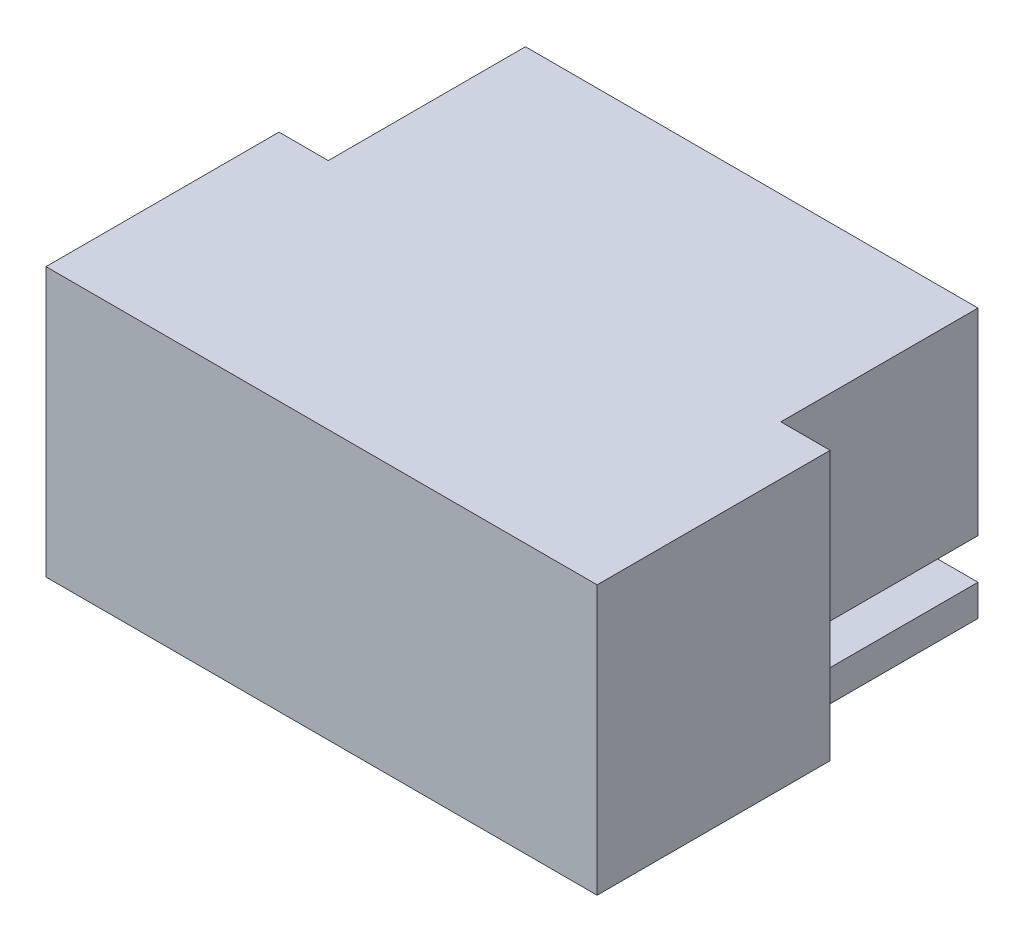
ISO-10303-21;
HEADER;
FILE_DESCRIPTION(('STEP AP214'),'2;1');
FILE_NAME('part.step','',(''),(''),'','','');
FILE_SCHEMA(('AUTOMOTIVE_DESIGN { 1 0 10303 214 1 1 1 1 }'));
ENDSEC;
DATA;
#1=APPLICATION_CONTEXT('core data for automotive mechanical design processes');
#2=APPLICATION_PROTOCOL_DEFINITION('international standard','automotive_design',2000,#1);
#3=PRODUCT_CONTEXT('',#1,'mechanical');
#4=PRODUCT('Part','Part','',(#3));
#5=PRODUCT_RELATED_PRODUCT_CATEGORY('part','',(#4));
#6=PRODUCT_DEFINITION_FORMATION('','',#4);
#7=PRODUCT_DEFINITION_CONTEXT('part definition',#1,'design');
#8=PRODUCT_DEFINITION('design','',#6,#7);
#9=PRODUCT_DEFINITION_SHAPE('','',#8);
#10=(LENGTH_UNIT() NAMED_UNIT(*) SI_UNIT(.MILLI.,.METRE.));
#11=(NAMED_UNIT(*) PLANE_ANGLE_UNIT() SI_UNIT($,.RADIAN.));
#12=(NAMED_UNIT(*) SI_UNIT($,.STERADIAN.) SOLID_ANGLE_UNIT());
#13=UNCERTAINTY_MEASURE_WITH_UNIT(LENGTH_MEASURE(1.E-05),#10,'distance_accuracy_value','');
#14=(GEOMETRIC_REPRESENTATION_CONTEXT(3) GLOBAL_UNCERTAINTY_ASSIGNED_CONTEXT((#13)) GLOBAL_UNIT_ASSIGNED_CONTEXT((#10,
#11,#12)) REPRESENTATION_CONTEXT('',''));
#15=CARTESIAN_POINT('',(0.,0.,0.));
#16=DIRECTION('',(0.,0.,1.));
#17=DIRECTION('',(1.,0.,0.));
#18=AXIS2_PLACEMENT_3D('',#15,#16,#17);
#19=CARTESIAN_POINT('',(-24.5,-25.085,-8.70710678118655));
#20=DIRECTION('',(1.,0.,0.));
#21=DIRECTION('',(0.,0.,-1.));
#22=AXIS2_PLACEMENT_3D('',#19,#20,#21);
#23=PLANE('',#22);
#24=DIRECTION('',(0.,0.,1.));
#25=VECTOR('',#24,1.);
#26=CARTESIAN_POINT('',(-24.5,-25.585,-8.70710678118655));
#27=LINE('',#26,#25);
#28=CARTESIAN_POINT('',(-24.5,-25.585,-6.7));
#29=VERTEX_POINT('',#28);
#30=CARTESIAN_POINT('',(-24.5,-25.585,-3.));
#31=VERTEX_POINT('',#30);
#32=EDGE_CURVE('E273',#29,#31,#27,.T.);
#33=ORIENTED_EDGE('',*,*,#32,.T.);
#34=DIRECTION('',(0.,1.,0.));
#35=VECTOR('',#34,1.);
#36=CARTESIAN_POINT('',(-24.5,-25.085,-3.));
#37=LINE('',#36,#35);
#38=CARTESIAN_POINT('',(-24.5,-25.085,-3.));
#39=VERTEX_POINT('',#38);
#40=EDGE_CURVE('E20',#39,#31,#37,.F.);
#41=ORIENTED_EDGE('',*,*,#40,.F.);
#42=DIRECTION('',(0.,0.,-1.));
#43=VECTOR('',#42,1.);
#44=CARTESIAN_POINT('',(-24.5,-25.085,-8.70710678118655));
#45=LINE('',#44,#43);
#46=CARTESIAN_POINT('',(-24.5,-25.085,-6.7));
#47=VERTEX_POINT('',#46);
#48=EDGE_CURVE('E295',#39,#47,#45,.T.);
#49=ORIENTED_EDGE('',*,*,#48,.T.);
#50=DIRECTION('',(0.,1.,0.));
#51=VECTOR('',#50,1.);
#52=CARTESIAN_POINT('',(-24.5,-25.085,-6.7));
#53=LINE('',#52,#51);
#54=EDGE_CURVE('E268',#29,#47,#53,.T.);
#55=ORIENTED_EDGE('',*,*,#54,.F.);
#56=EDGE_LOOP('',(#33,#41,#49,#55));
#57=FACE_BOUND('',#56,.T.);
#58=ADVANCED_FACE('F17',(#57),#23,.F.);
#59=CARTESIAN_POINT('',(-22.15,-25.085,-8.70710678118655));
#60=DIRECTION('',(1.,0.,0.));
#61=DIRECTION('',(0.,0.,-1.));
#62=AXIS2_PLACEMENT_3D('',#59,#60,#61);
#63=PLANE('',#62);
#64=DIRECTION('',(0.,0.,1.));
#65=VECTOR('',#64,1.);
#66=CARTESIAN_POINT('',(-22.15,-25.585,-8.70710678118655));
#67=LINE('',#66,#65);
#68=CARTESIAN_POINT('',(-22.15,-25.585,-6.7));
#69=VERTEX_POINT('',#68);
#70=CARTESIAN_POINT('',(-22.15,-25.585,-3.));
#71=VERTEX_POINT('',#70);
#72=EDGE_CURVE('E303',#69,#71,#67,.T.);
#73=ORIENTED_EDGE('',*,*,#72,.T.);
#74=DIRECTION('',(0.,1.,0.));
#75=VECTOR('',#74,1.);
#76=CARTESIAN_POINT('',(-22.15,-25.085,-3.));
#77=LINE('',#76,#75);
#78=CARTESIAN_POINT('',(-22.15,-25.085,-3.));
#79=VERTEX_POINT('',#78);
#80=EDGE_CURVE('E287',#79,#71,#77,.F.);
#81=ORIENTED_EDGE('',*,*,#80,.F.);
#82=DIRECTION('',(0.,0.,-1.));
#83=VECTOR('',#82,1.);
#84=CARTESIAN_POINT('',(-22.15,-25.085,-8.70710678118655));
#85=LINE('',#84,#83);
#86=CARTESIAN_POINT('',(-22.15,-25.085,-6.7));
#87=VERTEX_POINT('',#86);
#88=EDGE_CURVE('E313',#79,#87,#85,.T.);
#89=ORIENTED_EDGE('',*,*,#88,.T.);
#90=DIRECTION('',(0.,1.,0.));
#91=VECTOR('',#90,1.);
#92=CARTESIAN_POINT('',(-22.15,-25.085,-6.7));
#93=LINE('',#92,#91);
#94=EDGE_CURVE('E285',#69,#87,#93,.T.);
#95=ORIENTED_EDGE('',*,*,#94,.F.);
#96=EDGE_LOOP('',(#73,#81,#89,#95));
#97=FACE_BOUND('',#96,.T.);
#98=ADVANCED_FACE('F754',(#97),#63,.F.);
#99=CARTESIAN_POINT('',(-26.85,-25.085,-8.70710678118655));
#100=DIRECTION('',(1.,0.,0.));
#101=DIRECTION('',(0.,0.,-1.));
#102=AXIS2_PLACEMENT_3D('',#99,#100,#101);
#103=PLANE('',#102);
#104=DIRECTION('',(0.,0.,1.));
#105=VECTOR('',#104,1.);
#106=CARTESIAN_POINT('',(-26.85,-25.585,-8.70710678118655));
#107=LINE('',#106,#105);
#108=CARTESIAN_POINT('',(-26.85,-25.585,-6.7));
#109=VERTEX_POINT('',#108);
#110=CARTESIAN_POINT('',(-26.85,-25.585,-3.));
#111=VERTEX_POINT('',#110);
#112=EDGE_CURVE('E321',#109,#111,#107,.T.);
#113=ORIENTED_EDGE('',*,*,#112,.T.);
#114=DIRECTION('',(0.,1.,0.));
#115=VECTOR('',#114,1.);
#116=CARTESIAN_POINT('',(-26.85,-25.085,-3.));
#117=LINE('',#116,#115);
#118=CARTESIAN_POINT('',(-26.85,-25.085,-3.));
#119=VERTEX_POINT('',#118);
#120=EDGE_CURVE('E280',#119,#111,#117,.F.);
#121=ORIENTED_EDGE('',*,*,#120,.F.);
#122=DIRECTION('',(0.,0.,-1.));
#123=VECTOR('',#122,1.);
#124=CARTESIAN_POINT('',(-26.85,-25.085,-8.70710678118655));
#125=LINE('',#124,#123);
#126=CARTESIAN_POINT('',(-26.85,-25.085,-6.7));
#127=VERTEX_POINT('',#126);
#128=EDGE_CURVE('E329',#119,#127,#125,.T.);
#129=ORIENTED_EDGE('',*,*,#128,.T.);
#130=DIRECTION('',(0.,1.,0.));
#131=VECTOR('',#130,1.);
#132=CARTESIAN_POINT('',(-26.85,-25.085,-6.7));
#133=LINE('',#132,#131);
#134=EDGE_CURVE('E278',#109,#127,#133,.T.);
#135=ORIENTED_EDGE('',*,*,#134,.F.);
#136=EDGE_LOOP('',(#113,#121,#129,#135));
#137=FACE_BOUND('',#136,.T.);
#138=ADVANCED_FACE('F752',(#137),#103,.F.);
#139=CARTESIAN_POINT('',(-24.,-25.585,-8.70710678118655));
#140=DIRECTION('',(0.,1.,0.));
#141=DIRECTION('',(0.,0.,1.));
#142=AXIS2_PLACEMENT_3D('',#139,#140,#141);
#143=PLANE('',#142);
#144=DIRECTION('',(0.,0.,1.));
#145=VECTOR('',#144,1.);
#146=CARTESIAN_POINT('',(-24.,-25.585,-8.70710678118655));
#147=LINE('',#146,#145);
#148=CARTESIAN_POINT('',(-24.,-25.585,-6.7));
#149=VERTEX_POINT('',#148);
#150=CARTESIAN_POINT('',(-24.,-25.585,-3.));
#151=VERTEX_POINT('',#150);
#152=EDGE_CURVE('E275',#149,#151,#147,.T.);
#153=ORIENTED_EDGE('',*,*,#152,.T.);
#154=DIRECTION('',(1.,0.,0.));
#155=VECTOR('',#154,1.);
#156=CARTESIAN_POINT('',(-24.,-25.585,-3.));
#157=LINE('',#156,#155);
#158=EDGE_CURVE('E265',#31,#151,#157,.T.);
#159=ORIENTED_EDGE('',*,*,#158,.F.);
#160=ORIENTED_EDGE('',*,*,#32,.F.);
#161=DIRECTION('',(-1.,0.,0.));
#162=VECTOR('',#161,1.);
#163=CARTESIAN_POINT('',(0.,-25.585,-6.7));
#164=LINE('',#163,#162);
#165=EDGE_CURVE('E294',#149,#29,#164,.T.);
#166=ORIENTED_EDGE('',*,*,#165,.F.);
#167=EDGE_LOOP('',(#153,#159,#160,#166));
#168=FACE_BOUND('',#167,.T.);
#169=ADVANCED_FACE('F271',(#168),#143,.F.);
#170=CARTESIAN_POINT('',(-24.,-25.085,-8.70710678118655));
#171=DIRECTION('',(0.,-1.,0.));
#172=DIRECTION('',(0.,0.,-1.));
#173=AXIS2_PLACEMENT_3D('',#170,#171,#172);
#174=PLANE('',#173);
#175=ORIENTED_EDGE('',*,*,#48,.F.);
#176=DIRECTION('',(1.,0.,0.));
#177=VECTOR('',#176,1.);
#178=CARTESIAN_POINT('',(-24.,-25.085,-3.));
#179=LINE('',#178,#177);
#180=CARTESIAN_POINT('',(-24.,-25.085,-3.));
#181=VERTEX_POINT('',#180);
#182=EDGE_CURVE('E267',#181,#39,#179,.F.);
#183=ORIENTED_EDGE('',*,*,#182,.F.);
#184=DIRECTION('',(0.,0.,1.));
#185=VECTOR('',#184,1.);
#186=CARTESIAN_POINT('',(-24.,-25.085,-8.70710678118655));
#187=LINE('',#186,#185);
#188=CARTESIAN_POINT('',(-24.,-25.085,-6.7));
#189=VERTEX_POINT('',#188);
#190=EDGE_CURVE('E301',#181,#189,#187,.F.);
#191=ORIENTED_EDGE('',*,*,#190,.T.);
#192=DIRECTION('',(-1.,0.,0.));
#193=VECTOR('',#192,1.);
#194=CARTESIAN_POINT('',(0.,-25.085,-6.7));
#195=LINE('',#194,#193);
#196=EDGE_CURVE('E292',#47,#189,#195,.F.);
#197=ORIENTED_EDGE('',*,*,#196,.F.);
#198=EDGE_LOOP('',(#175,#183,#191,#197));
#199=FACE_BOUND('',#198,.T.);
#200=ADVANCED_FACE('F299',(#199),#174,.F.);
#201=CARTESIAN_POINT('',(0.,0.,-6.7));
#202=DIRECTION('',(0.,0.,-1.));
#203=DIRECTION('',(-1.,0.,0.));
#204=AXIS2_PLACEMENT_3D('',#201,#202,#203);
#205=PLANE('',#204);
#206=ORIENTED_EDGE('',*,*,#165,.T.);
#207=ORIENTED_EDGE('',*,*,#54,.T.);
#208=ORIENTED_EDGE('',*,*,#196,.T.);
#209=DIRECTION('',(0.,1.,0.));
#210=VECTOR('',#209,1.);
#211=CARTESIAN_POINT('',(-24.,-25.085,-6.7));
#212=LINE('',#211,#210);
#213=EDGE_CURVE('E339',#189,#149,#212,.F.);
#214=ORIENTED_EDGE('',*,*,#213,.T.);
#215=EDGE_LOOP('',(#206,#207,#208,#214));
#216=FACE_BOUND('',#215,.T.);
#217=ADVANCED_FACE('F289',(#216),#205,.T.);
#218=CARTESIAN_POINT('',(-21.65,-25.585,-8.70710678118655));
#219=DIRECTION('',(0.,1.,0.));
#220=DIRECTION('',(0.,0.,1.));
#221=AXIS2_PLACEMENT_3D('',#218,#219,#220);
#222=PLANE('',#221);
#223=DIRECTION('',(0.,0.,1.));
#224=VECTOR('',#223,1.);
#225=CARTESIAN_POINT('',(-21.65,-25.585,-8.70710678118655));
#226=LINE('',#225,#224);
#227=CARTESIAN_POINT('',(-21.65,-25.585,-6.7));
#228=VERTEX_POINT('',#227);
#229=CARTESIAN_POINT('',(-21.65,-25.585,-3.));
#230=VERTEX_POINT('',#229);
#231=EDGE_CURVE('E341',#228,#230,#226,.T.);
#232=ORIENTED_EDGE('',*,*,#231,.T.);
#233=DIRECTION('',(1.,0.,0.));
#234=VECTOR('',#233,1.);
#235=CARTESIAN_POINT('',(-21.65,-25.585,-3.));
#236=LINE('',#235,#234);
#237=EDGE_CURVE('E308',#71,#230,#236,.T.);
#238=ORIENTED_EDGE('',*,*,#237,.F.);
#239=ORIENTED_EDGE('',*,*,#72,.F.);
#240=DIRECTION('',(-1.,0.,0.));
#241=VECTOR('',#240,1.);
#242=CARTESIAN_POINT('',(0.,-25.585,-6.7));
#243=LINE('',#242,#241);
#244=EDGE_CURVE('E318',#228,#69,#243,.T.);
#245=ORIENTED_EDGE('',*,*,#244,.F.);
#246=EDGE_LOOP('',(#232,#238,#239,#245));
#247=FACE_BOUND('',#246,.T.);
#248=ADVANCED_FACE('F741',(#247),#222,.F.);
#249=CARTESIAN_POINT('',(-21.65,-25.085,-8.70710678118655));
#250=DIRECTION('',(0.,-1.,0.));
#251=DIRECTION('',(0.,0.,-1.));
#252=AXIS2_PLACEMENT_3D('',#249,#250,#251);
#253=PLANE('',#252);
#254=ORIENTED_EDGE('',*,*,#88,.F.);
#255=DIRECTION('',(1.,0.,0.));
#256=VECTOR('',#255,1.);
#257=CARTESIAN_POINT('',(-21.65,-25.085,-3.));
#258=LINE('',#257,#256);
#259=CARTESIAN_POINT('',(-21.65,-25.085,-3.));
#260=VERTEX_POINT('',#259);
#261=EDGE_CURVE('E310',#260,#79,#258,.F.);
#262=ORIENTED_EDGE('',*,*,#261,.F.);
#263=DIRECTION('',(0.,0.,1.));
#264=VECTOR('',#263,1.);
#265=CARTESIAN_POINT('',(-21.65,-25.085,-8.70710678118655));
#266=LINE('',#265,#264);
#267=CARTESIAN_POINT('',(-21.65,-25.085,-6.7));
#268=VERTEX_POINT('',#267);
#269=EDGE_CURVE('E344',#260,#268,#266,.F.);
#270=ORIENTED_EDGE('',*,*,#269,.T.);
#271=DIRECTION('',(-1.,0.,0.));
#272=VECTOR('',#271,1.);
#273=CARTESIAN_POINT('',(0.,-25.085,-6.7));
#274=LINE('',#273,#272);
#275=EDGE_CURVE('E316',#87,#268,#274,.F.);
#276=ORIENTED_EDGE('',*,*,#275,.F.);
#277=EDGE_LOOP('',(#254,#262,#270,#276));
#278=FACE_BOUND('',#277,.T.);
#279=ADVANCED_FACE('F737',(#278),#253,.F.);
#280=CARTESIAN_POINT('',(0.,0.,-6.7));
#281=DIRECTION('',(0.,0.,-1.));
#282=DIRECTION('',(-1.,0.,0.));
#283=AXIS2_PLACEMENT_3D('',#280,#281,#282);
#284=PLANE('',#283);
#285=ORIENTED_EDGE('',*,*,#244,.T.);
#286=ORIENTED_EDGE('',*,*,#94,.T.);
#287=ORIENTED_EDGE('',*,*,#275,.T.);
#288=DIRECTION('',(0.,1.,0.));
#289=VECTOR('',#288,1.);
#290=CARTESIAN_POINT('',(-21.65,-25.085,-6.7));
#291=LINE('',#290,#289);
#292=EDGE_CURVE('E347',#268,#228,#291,.F.);
#293=ORIENTED_EDGE('',*,*,#292,.T.);
#294=EDGE_LOOP('',(#285,#286,#287,#293));
#295=FACE_BOUND('',#294,.T.);
#296=ADVANCED_FACE('F733',(#295),#284,.T.);
#297=CARTESIAN_POINT('',(-26.35,-25.585,-8.70710678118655));
#298=DIRECTION('',(0.,1.,0.));
#299=DIRECTION('',(0.,0.,1.));
#300=AXIS2_PLACEMENT_3D('',#297,#298,#299);
#301=PLANE('',#300);
#302=DIRECTION('',(0.,0.,1.));
#303=VECTOR('',#302,1.);
#304=CARTESIAN_POINT('',(-26.35,-25.585,-8.70710678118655));
#305=LINE('',#304,#303);
#306=CARTESIAN_POINT('',(-26.35,-25.585,-6.7));
#307=VERTEX_POINT('',#306);
#308=CARTESIAN_POINT('',(-26.35,-25.585,-3.));
#309=VERTEX_POINT('',#308);
#310=EDGE_CURVE('E350',#307,#309,#305,.T.);
#311=ORIENTED_EDGE('',*,*,#310,.T.);
#312=DIRECTION('',(1.,0.,0.));
#313=VECTOR('',#312,1.);
#314=CARTESIAN_POINT('',(-26.35,-25.585,-3.));
#315=LINE('',#314,#313);
#316=EDGE_CURVE('E324',#111,#309,#315,.T.);
#317=ORIENTED_EDGE('',*,*,#316,.F.);
#318=ORIENTED_EDGE('',*,*,#112,.F.);
#319=DIRECTION('',(-1.,0.,0.));
#320=VECTOR('',#319,1.);
#321=CARTESIAN_POINT('',(0.,-25.585,-6.7));
#322=LINE('',#321,#320);
#323=EDGE_CURVE('E334',#307,#109,#322,.T.);
#324=ORIENTED_EDGE('',*,*,#323,.F.);
#325=EDGE_LOOP('',(#311,#317,#318,#324));
#326=FACE_BOUND('',#325,.T.);
#327=ADVANCED_FACE('F729',(#326),#301,.F.);
#328=CARTESIAN_POINT('',(-26.35,-25.085,-8.70710678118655));
#329=DIRECTION('',(0.,-1.,0.));
#330=DIRECTION('',(0.,0.,-1.));
#331=AXIS2_PLACEMENT_3D('',#328,#329,#330);
#332=PLANE('',#331);
#333=ORIENTED_EDGE('',*,*,#128,.F.);
#334=DIRECTION('',(1.,0.,0.));
#335=VECTOR('',#334,1.);
#336=CARTESIAN_POINT('',(-26.35,-25.085,-3.));
#337=LINE('',#336,#335);
#338=CARTESIAN_POINT('',(-26.35,-25.085,-3.));
#339=VERTEX_POINT('',#338);
#340=EDGE_CURVE('E326',#339,#119,#337,.F.);
#341=ORIENTED_EDGE('',*,*,#340,.F.);
#342=DIRECTION('',(0.,0.,1.));
#343=VECTOR('',#342,1.);
#344=CARTESIAN_POINT('',(-26.35,-25.085,-8.70710678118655));
#345=LINE('',#344,#343);
#346=CARTESIAN_POINT('',(-26.35,-25.085,-6.7));
#347=VERTEX_POINT('',#346);
#348=EDGE_CURVE('E353',#339,#347,#345,.F.);
#349=ORIENTED_EDGE('',*,*,#348,.T.);
#350=DIRECTION('',(-1.,0.,0.));
#351=VECTOR('',#350,1.);
#352=CARTESIAN_POINT('',(0.,-25.085,-6.7));
#353=LINE('',#352,#351);
#354=EDGE_CURVE('E332',#127,#347,#353,.F.);
#355=ORIENTED_EDGE('',*,*,#354,.F.);
#356=EDGE_LOOP('',(#333,#341,#349,#355));
#357=FACE_BOUND('',#356,.T.);
#358=ADVANCED_FACE('F725',(#357),#332,.F.);
#359=CARTESIAN_POINT('',(0.,0.,-6.7));
#360=DIRECTION('',(0.,0.,-1.));
#361=DIRECTION('',(-1.,0.,0.));
#362=AXIS2_PLACEMENT_3D('',#359,#360,#361);
#363=PLANE('',#362);
#364=ORIENTED_EDGE('',*,*,#323,.T.);
#365=ORIENTED_EDGE('',*,*,#134,.T.);
#366=ORIENTED_EDGE('',*,*,#354,.T.);
#367=DIRECTION('',(0.,1.,0.));
#368=VECTOR('',#367,1.);
#369=CARTESIAN_POINT('',(-26.35,-25.085,-6.7));
#370=LINE('',#369,#368);
#371=EDGE_CURVE('E356',#347,#307,#370,.F.);
#372=ORIENTED_EDGE('',*,*,#371,.T.);
#373=EDGE_LOOP('',(#364,#365,#366,#372));
#374=FACE_BOUND('',#373,.T.);
#375=ADVANCED_FACE('F721',(#374),#363,.T.);
#376=CARTESIAN_POINT('',(-24.,-25.085,-8.70710678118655));
#377=DIRECTION('',(-1.,0.,0.));
#378=DIRECTION('',(0.,0.,1.));
#379=AXIS2_PLACEMENT_3D('',#376,#377,#378);
#380=PLANE('',#379);
#381=ORIENTED_EDGE('',*,*,#190,.F.);
#382=DIRECTION('',(0.,1.,0.));
#383=VECTOR('',#382,1.);
#384=CARTESIAN_POINT('',(-24.,0.,-3.));
#385=LINE('',#384,#383);
#386=EDGE_CURVE('E393',#181,#151,#385,.F.);
#387=ORIENTED_EDGE('',*,*,#386,.T.);
#388=ORIENTED_EDGE('',*,*,#152,.F.);
#389=ORIENTED_EDGE('',*,*,#213,.F.);
#390=EDGE_LOOP('',(#381,#387,#388,#389));
#391=FACE_BOUND('',#390,.T.);
#392=ADVANCED_FACE('F717',(#391),#380,.F.);
#393=CARTESIAN_POINT('',(-25.45,-26.485,-3.));
#394=DIRECTION('',(0.,-1.,0.));
#395=DIRECTION('',(0.,0.,-1.));
#396=AXIS2_PLACEMENT_3D('',#393,#394,#395);
#397=PLANE('',#396);
#398=DIRECTION('',(0.,0.,-1.));
#399=VECTOR('',#398,1.);
#400=CARTESIAN_POINT('',(-25.45,-26.485,-3.));
#401=LINE('',#400,#399);
#402=CARTESIAN_POINT('',(-25.45,-26.485,-8.));
#403=VERTEX_POINT('',#402);
#404=CARTESIAN_POINT('',(-25.45,-26.485,-3.));
#405=VERTEX_POINT('',#404);
#406=EDGE_CURVE('E388',#403,#405,#401,.F.);
#407=ORIENTED_EDGE('',*,*,#406,.T.);
#408=DIRECTION('',(1.,0.,0.));
#409=VECTOR('',#408,1.);
#410=CARTESIAN_POINT('',(0.,-26.485,-3.));
#411=LINE('',#410,#409);
#412=CARTESIAN_POINT('',(-22.85,-26.485,-3.));
#413=VERTEX_POINT('',#412);
#414=EDGE_CURVE('E400',#405,#413,#411,.T.);
#415=ORIENTED_EDGE('',*,*,#414,.T.);
#416=DIRECTION('',(0.,0.,1.));
#417=VECTOR('',#416,1.);
#418=CARTESIAN_POINT('',(-22.85,-26.485,-3.));
#419=LINE('',#418,#417);
#420=CARTESIAN_POINT('',(-22.85,-26.485,-8.));
#421=VERTEX_POINT('',#420);
#422=EDGE_CURVE('E381',#413,#421,#419,.F.);
#423=ORIENTED_EDGE('',*,*,#422,.T.);
#424=DIRECTION('',(-1.,0.,0.));
#425=VECTOR('',#424,1.);
#426=CARTESIAN_POINT('',(0.,-26.485,-8.));
#427=LINE('',#426,#425);
#428=EDGE_CURVE('E384',#403,#421,#427,.F.);
#429=ORIENTED_EDGE('',*,*,#428,.F.);
#430=EDGE_LOOP('',(#407,#415,#423,#429));
#431=FACE_BOUND('',#430,.T.);
#432=ADVANCED_FACE('F713',(#431),#397,.F.);
#433=CARTESIAN_POINT('',(-19.95,-26.485,-3.));
#434=DIRECTION('',(0.,-1.,0.));
#435=DIRECTION('',(0.,0.,-1.));
#436=AXIS2_PLACEMENT_3D('',#433,#434,#435);
#437=PLANE('',#436);
#438=DIRECTION('',(0.,0.,-1.));
#439=VECTOR('',#438,1.);
#440=CARTESIAN_POINT('',(-21.05,-26.485,-3.));
#441=LINE('',#440,#439);
#442=CARTESIAN_POINT('',(-21.05,-26.485,-8.));
#443=VERTEX_POINT('',#442);
#444=CARTESIAN_POINT('',(-21.05,-26.485,-3.));
#445=VERTEX_POINT('',#444);
#446=EDGE_CURVE('E376',#443,#445,#441,.F.);
#447=ORIENTED_EDGE('',*,*,#446,.T.);
#448=DIRECTION('',(1.,0.,0.));
#449=VECTOR('',#448,1.);
#450=CARTESIAN_POINT('',(0.,-26.485,-3.));
#451=LINE('',#450,#449);
#452=CARTESIAN_POINT('',(-19.1,-26.485,-3.));
#453=VERTEX_POINT('',#452);
#454=EDGE_CURVE('E408',#445,#453,#451,.T.);
#455=ORIENTED_EDGE('',*,*,#454,.T.);
#456=DIRECTION('',(0.,0.,-1.));
#457=VECTOR('',#456,1.);
#458=CARTESIAN_POINT('',(-19.1,-26.485,-3.));
#459=LINE('',#458,#457);
#460=CARTESIAN_POINT('',(-19.1,-26.485,-3.6));
#461=VERTEX_POINT('',#460);
#462=EDGE_CURVE('E361',#453,#461,#459,.T.);
#463=ORIENTED_EDGE('',*,*,#462,.T.);
#464=DIRECTION('',(0.,0.,1.));
#465=VECTOR('',#464,1.);
#466=CARTESIAN_POINT('',(-19.1,-26.485,-3.6));
#467=LINE('',#466,#465);
#468=CARTESIAN_POINT('',(-19.1,-26.485,-8.));
#469=VERTEX_POINT('',#468);
#470=EDGE_CURVE('E369',#461,#469,#467,.F.);
#471=ORIENTED_EDGE('',*,*,#470,.T.);
#472=DIRECTION('',(-1.,0.,0.));
#473=VECTOR('',#472,1.);
#474=CARTESIAN_POINT('',(0.,-26.485,-8.));
#475=LINE('',#474,#473);
#476=EDGE_CURVE('E372',#443,#469,#475,.F.);
#477=ORIENTED_EDGE('',*,*,#476,.F.);
#478=EDGE_LOOP('',(#447,#455,#463,#471,#477));
#479=FACE_BOUND('',#478,.T.);
#480=ADVANCED_FACE('F709',(#479),#437,.F.);
#481=CARTESIAN_POINT('',(-21.65,-25.085,-8.70710678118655));
#482=DIRECTION('',(-1.,0.,0.));
#483=DIRECTION('',(0.,0.,1.));
#484=AXIS2_PLACEMENT_3D('',#481,#482,#483);
#485=PLANE('',#484);
#486=ORIENTED_EDGE('',*,*,#269,.F.);
#487=DIRECTION('',(0.,1.,0.));
#488=VECTOR('',#487,1.);
#489=CARTESIAN_POINT('',(-21.65,0.,-3.));
#490=LINE('',#489,#488);
#491=EDGE_CURVE('E413',#260,#230,#490,.F.);
#492=ORIENTED_EDGE('',*,*,#491,.T.);
#493=ORIENTED_EDGE('',*,*,#231,.F.);
#494=ORIENTED_EDGE('',*,*,#292,.F.);
#495=EDGE_LOOP('',(#486,#492,#493,#494));
#496=FACE_BOUND('',#495,.T.);
#497=ADVANCED_FACE('F705',(#496),#485,.F.);
#498=CARTESIAN_POINT('',(-26.35,-25.085,-8.70710678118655));
#499=DIRECTION('',(-1.,0.,0.));
#500=DIRECTION('',(0.,0.,1.));
#501=AXIS2_PLACEMENT_3D('',#498,#499,#500);
#502=PLANE('',#501);
#503=ORIENTED_EDGE('',*,*,#348,.F.);
#504=DIRECTION('',(0.,1.,0.));
#505=VECTOR('',#504,1.);
#506=CARTESIAN_POINT('',(-26.35,0.,-3.));
#507=LINE('',#506,#505);
#508=EDGE_CURVE('E416',#339,#309,#507,.F.);
#509=ORIENTED_EDGE('',*,*,#508,.T.);
#510=ORIENTED_EDGE('',*,*,#310,.F.);
#511=ORIENTED_EDGE('',*,*,#371,.F.);
#512=EDGE_LOOP('',(#503,#509,#510,#511));
#513=FACE_BOUND('',#512,.T.);
#514=ADVANCED_FACE('F701',(#513),#502,.F.);
#515=CARTESIAN_POINT('',(-28.35,-26.485,-3.));
#516=DIRECTION('',(0.,-1.,0.));
#517=DIRECTION('',(0.,0.,-1.));
#518=AXIS2_PLACEMENT_3D('',#515,#516,#517);
#519=PLANE('',#518);
#520=DIRECTION('',(0.,0.,-1.));
#521=VECTOR('',#520,1.);
#522=CARTESIAN_POINT('',(-29.2,-26.485,-3.6));
#523=LINE('',#522,#521);
#524=CARTESIAN_POINT('',(-29.2,-26.485,-8.));
#525=VERTEX_POINT('',#524);
#526=CARTESIAN_POINT('',(-29.2,-26.485,-3.6));
#527=VERTEX_POINT('',#526);
#528=EDGE_CURVE('E364',#525,#527,#523,.F.);
#529=ORIENTED_EDGE('',*,*,#528,.T.);
#530=DIRECTION('',(0.,0.,-1.));
#531=VECTOR('',#530,1.);
#532=CARTESIAN_POINT('',(-29.2,-26.485,-3.));
#533=LINE('',#532,#531);
#534=CARTESIAN_POINT('',(-29.2,-26.485,-3.));
#535=VERTEX_POINT('',#534);
#536=EDGE_CURVE('E359',#535,#527,#533,.T.);
#537=ORIENTED_EDGE('',*,*,#536,.F.);
#538=DIRECTION('',(1.,0.,0.));
#539=VECTOR('',#538,1.);
#540=CARTESIAN_POINT('',(0.,-26.485,-3.));
#541=LINE('',#540,#539);
#542=CARTESIAN_POINT('',(-27.25,-26.485,-3.));
#543=VERTEX_POINT('',#542);
#544=EDGE_CURVE('E395',#535,#543,#541,.T.);
#545=ORIENTED_EDGE('',*,*,#544,.T.);
#546=DIRECTION('',(0.,0.,1.));
#547=VECTOR('',#546,1.);
#548=CARTESIAN_POINT('',(-27.25,-26.485,-3.));
#549=LINE('',#548,#547);
#550=CARTESIAN_POINT('',(-27.25,-26.485,-8.));
#551=VERTEX_POINT('',#550);
#552=EDGE_CURVE('E422',#543,#551,#549,.F.);
#553=ORIENTED_EDGE('',*,*,#552,.T.);
#554=DIRECTION('',(-1.,0.,0.));
#555=VECTOR('',#554,1.);
#556=CARTESIAN_POINT('',(0.,-26.485,-8.));
#557=LINE('',#556,#555);
#558=EDGE_CURVE('E425',#525,#551,#557,.F.);
#559=ORIENTED_EDGE('',*,*,#558,.F.);
#560=EDGE_LOOP('',(#529,#537,#545,#553,#559));
#561=FACE_BOUND('',#560,.T.);
#562=ADVANCED_FACE('F697',(#561),#519,.F.);
#563=CARTESIAN_POINT('',(-19.1,-25.585,-3.));
#564=DIRECTION('',(1.,0.,0.));
#565=DIRECTION('',(0.,0.,-1.));
#566=AXIS2_PLACEMENT_3D('',#563,#564,#565);
#567=PLANE('',#566);
#568=ORIENTED_EDGE('',*,*,#462,.F.);
#569=DIRECTION('',(0.,1.,0.));
#570=VECTOR('',#569,1.);
#571=CARTESIAN_POINT('',(-19.1,0.,-3.));
#572=LINE('',#571,#570);
#573=CARTESIAN_POINT('',(-19.1,-25.585,-3.));
#574=VERTEX_POINT('',#573);
#575=EDGE_CURVE('E411',#453,#574,#572,.T.);
#576=ORIENTED_EDGE('',*,*,#575,.T.);
#577=DIRECTION('',(0.,0.,1.));
#578=VECTOR('',#577,1.);
#579=CARTESIAN_POINT('',(-19.1,-25.585,-3.));
#580=LINE('',#579,#578);
#581=CARTESIAN_POINT('',(-19.1,-25.585,-3.6));
#582=VERTEX_POINT('',#581);
#583=EDGE_CURVE('E464',#574,#582,#580,.F.);
#584=ORIENTED_EDGE('',*,*,#583,.T.);
#585=DIRECTION('',(0.,1.,0.));
#586=VECTOR('',#585,1.);
#587=CARTESIAN_POINT('',(-19.1,0.,-3.6));
#588=LINE('',#587,#586);
#589=EDGE_CURVE('E470',#461,#582,#588,.T.);
#590=ORIENTED_EDGE('',*,*,#589,.F.);
#591=EDGE_LOOP('',(#568,#576,#584,#590));
#592=FACE_BOUND('',#591,.T.);
#593=ADVANCED_FACE('F693',(#592),#567,.F.);
#594=CARTESIAN_POINT('',(-29.2,-21.185,-3.6));
#595=DIRECTION('',(1.,0.,0.));
#596=DIRECTION('',(0.,0.,-1.));
#597=AXIS2_PLACEMENT_3D('',#594,#595,#596);
#598=PLANE('',#597);
#599=ORIENTED_EDGE('',*,*,#528,.F.);
#600=DIRECTION('',(0.,1.,0.));
#601=VECTOR('',#600,1.);
#602=CARTESIAN_POINT('',(-29.2,0.,-8.));
#603=LINE('',#602,#601);
#604=CARTESIAN_POINT('',(-29.2,-27.185,-8.));
#605=VERTEX_POINT('',#604);
#606=EDGE_CURVE('E429',#605,#525,#603,.T.);
#607=ORIENTED_EDGE('',*,*,#606,.F.);
#608=DIRECTION('',(0.,0.,1.));
#609=VECTOR('',#608,1.);
#610=CARTESIAN_POINT('',(-29.2,-27.185,-8.));
#611=LINE('',#610,#609);
#612=CARTESIAN_POINT('',(-29.2,-27.185,-3.6));
#613=VERTEX_POINT('',#612);
#614=EDGE_CURVE('E474',#605,#613,#611,.T.);
#615=ORIENTED_EDGE('',*,*,#614,.T.);
#616=DIRECTION('',(0.,1.,0.));
#617=VECTOR('',#616,1.);
#618=CARTESIAN_POINT('',(-29.2,-21.185,-3.6));
#619=LINE('',#618,#617);
#620=EDGE_CURVE('E367',#527,#613,#619,.F.);
#621=ORIENTED_EDGE('',*,*,#620,.F.);
#622=EDGE_LOOP('',(#599,#607,#615,#621));
#623=FACE_BOUND('',#622,.T.);
#624=ADVANCED_FACE('F689',(#623),#598,.F.);
#625=CARTESIAN_POINT('',(-19.1,-21.185,-3.6));
#626=DIRECTION('',(-1.,0.,0.));
#627=DIRECTION('',(0.,0.,1.));
#628=AXIS2_PLACEMENT_3D('',#625,#626,#627);
#629=PLANE('',#628);
#630=ORIENTED_EDGE('',*,*,#470,.F.);
#631=DIRECTION('',(0.,1.,0.));
#632=VECTOR('',#631,1.);
#633=CARTESIAN_POINT('',(-19.1,0.,-3.6));
#634=LINE('',#633,#632);
#635=CARTESIAN_POINT('',(-19.1,-27.185,-3.6));
#636=VERTEX_POINT('',#635);
#637=EDGE_CURVE('E467',#636,#461,#634,.T.);
#638=ORIENTED_EDGE('',*,*,#637,.F.);
#639=DIRECTION('',(0.,0.,1.));
#640=VECTOR('',#639,1.);
#641=CARTESIAN_POINT('',(-19.1,-27.185,-8.));
#642=LINE('',#641,#640);
#643=CARTESIAN_POINT('',(-19.1,-27.185,-8.));
#644=VERTEX_POINT('',#643);
#645=EDGE_CURVE('E480',#636,#644,#642,.F.);
#646=ORIENTED_EDGE('',*,*,#645,.T.);
#647=DIRECTION('',(0.,1.,0.));
#648=VECTOR('',#647,1.);
#649=CARTESIAN_POINT('',(-19.1,0.,-8.));
#650=LINE('',#649,#648);
#651=EDGE_CURVE('E374',#469,#644,#650,.F.);
#652=ORIENTED_EDGE('',*,*,#651,.F.);
#653=EDGE_LOOP('',(#630,#638,#646,#652));
#654=FACE_BOUND('',#653,.T.);
#655=ADVANCED_FACE('F685',(#654),#629,.F.);
#656=CARTESIAN_POINT('',(0.,0.,-8.));
#657=DIRECTION('',(0.,0.,-1.));
#658=DIRECTION('',(-1.,0.,0.));
#659=AXIS2_PLACEMENT_3D('',#656,#657,#658);
#660=PLANE('',#659);
#661=ORIENTED_EDGE('',*,*,#651,.T.);
#662=DIRECTION('',(1.,0.,0.));
#663=VECTOR('',#662,1.);
#664=CARTESIAN_POINT('',(-18.,-27.185,-8.));
#665=LINE('',#664,#663);
#666=CARTESIAN_POINT('',(-21.05,-27.185,-8.));
#667=VERTEX_POINT('',#666);
#668=EDGE_CURVE('E483',#644,#667,#665,.F.);
#669=ORIENTED_EDGE('',*,*,#668,.T.);
#670=DIRECTION('',(0.,1.,0.));
#671=VECTOR('',#670,1.);
#672=CARTESIAN_POINT('',(-21.05,-26.485,-8.));
#673=LINE('',#672,#671);
#674=EDGE_CURVE('E378',#667,#443,#673,.T.);
#675=ORIENTED_EDGE('',*,*,#674,.T.);
#676=ORIENTED_EDGE('',*,*,#476,.T.);
#677=EDGE_LOOP('',(#661,#669,#675,#676));
#678=FACE_BOUND('',#677,.T.);
#679=ADVANCED_FACE('F681',(#678),#660,.T.);
#680=CARTESIAN_POINT('',(-21.05,-26.485,-3.));
#681=DIRECTION('',(1.,0.,0.));
#682=DIRECTION('',(0.,0.,-1.));
#683=AXIS2_PLACEMENT_3D('',#680,#681,#682);
#684=PLANE('',#683);
#685=DIRECTION('',(0.,0.,1.));
#686=VECTOR('',#685,1.);
#687=CARTESIAN_POINT('',(-21.05,-27.185,-8.));
#688=LINE('',#687,#686);
#689=CARTESIAN_POINT('',(-21.05,-27.185,-3.));
#690=VERTEX_POINT('',#689);
#691=EDGE_CURVE('E486',#667,#690,#688,.T.);
#692=ORIENTED_EDGE('',*,*,#691,.T.);
#693=DIRECTION('',(0.,1.,0.));
#694=VECTOR('',#693,1.);
#695=CARTESIAN_POINT('',(-21.05,0.,-3.));
#696=LINE('',#695,#694);
#697=EDGE_CURVE('E405',#690,#445,#696,.T.);
#698=ORIENTED_EDGE('',*,*,#697,.T.);
#699=ORIENTED_EDGE('',*,*,#446,.F.);
#700=ORIENTED_EDGE('',*,*,#674,.F.);
#701=EDGE_LOOP('',(#692,#698,#699,#700));
#702=FACE_BOUND('',#701,.T.);
#703=ADVANCED_FACE('F677',(#702),#684,.F.);
#704=CARTESIAN_POINT('',(-22.85,-26.485,-3.));
#705=DIRECTION('',(-1.,0.,0.));
#706=DIRECTION('',(0.,0.,1.));
#707=AXIS2_PLACEMENT_3D('',#704,#705,#706);
#708=PLANE('',#707);
#709=ORIENTED_EDGE('',*,*,#422,.F.);
#710=DIRECTION('',(0.,1.,0.));
#711=VECTOR('',#710,1.);
#712=CARTESIAN_POINT('',(-22.85,0.,-3.));
#713=LINE('',#712,#711);
#714=CARTESIAN_POINT('',(-22.85,-27.185,-3.));
#715=VERTEX_POINT('',#714);
#716=EDGE_CURVE('E403',#413,#715,#713,.F.);
#717=ORIENTED_EDGE('',*,*,#716,.T.);
#718=DIRECTION('',(0.,0.,1.));
#719=VECTOR('',#718,1.);
#720=CARTESIAN_POINT('',(-22.85,-27.185,-8.));
#721=LINE('',#720,#719);
#722=CARTESIAN_POINT('',(-22.85,-27.185,-8.));
#723=VERTEX_POINT('',#722);
#724=EDGE_CURVE('E492',#715,#723,#721,.F.);
#725=ORIENTED_EDGE('',*,*,#724,.T.);
#726=DIRECTION('',(0.,1.,0.));
#727=VECTOR('',#726,1.);
#728=CARTESIAN_POINT('',(-22.85,0.,-8.));
#729=LINE('',#728,#727);
#730=EDGE_CURVE('E386',#421,#723,#729,.F.);
#731=ORIENTED_EDGE('',*,*,#730,.F.);
#732=EDGE_LOOP('',(#709,#717,#725,#731));
#733=FACE_BOUND('',#732,.T.);
#734=ADVANCED_FACE('F673',(#733),#708,.F.);
#735=CARTESIAN_POINT('',(0.,0.,-8.));
#736=DIRECTION('',(0.,0.,-1.));
#737=DIRECTION('',(-1.,0.,0.));
#738=AXIS2_PLACEMENT_3D('',#735,#736,#737);
#739=PLANE('',#738);
#740=ORIENTED_EDGE('',*,*,#730,.T.);
#741=DIRECTION('',(1.,0.,0.));
#742=VECTOR('',#741,1.);
#743=CARTESIAN_POINT('',(-18.,-27.185,-8.));
#744=LINE('',#743,#742);
#745=CARTESIAN_POINT('',(-25.45,-27.185,-8.));
#746=VERTEX_POINT('',#745);
#747=EDGE_CURVE('E495',#723,#746,#744,.F.);
#748=ORIENTED_EDGE('',*,*,#747,.T.);
#749=DIRECTION('',(0.,1.,0.));
#750=VECTOR('',#749,1.);
#751=CARTESIAN_POINT('',(-25.45,-27.185,-8.));
#752=LINE('',#751,#750);
#753=EDGE_CURVE('E390',#746,#403,#752,.T.);
#754=ORIENTED_EDGE('',*,*,#753,.T.);
#755=ORIENTED_EDGE('',*,*,#428,.T.);
#756=EDGE_LOOP('',(#740,#748,#754,#755));
#757=FACE_BOUND('',#756,.T.);
#758=ADVANCED_FACE('F669',(#757),#739,.T.);
#759=CARTESIAN_POINT('',(-25.45,-27.185,-3.));
#760=DIRECTION('',(1.,0.,0.));
#761=DIRECTION('',(0.,0.,-1.));
#762=AXIS2_PLACEMENT_3D('',#759,#760,#761);
#763=PLANE('',#762);
#764=DIRECTION('',(0.,0.,1.));
#765=VECTOR('',#764,1.);
#766=CARTESIAN_POINT('',(-25.45,-27.185,-8.));
#767=LINE('',#766,#765);
#768=CARTESIAN_POINT('',(-25.45,-27.185,-3.));
#769=VERTEX_POINT('',#768);
#770=EDGE_CURVE('E498',#746,#769,#767,.T.);
#771=ORIENTED_EDGE('',*,*,#770,.T.);
#772=DIRECTION('',(0.,1.,0.));
#773=VECTOR('',#772,1.);
#774=CARTESIAN_POINT('',(-25.45,0.,-3.));
#775=LINE('',#774,#773);
#776=EDGE_CURVE('E397',#769,#405,#775,.T.);
#777=ORIENTED_EDGE('',*,*,#776,.T.);
#778=ORIENTED_EDGE('',*,*,#406,.F.);
#779=ORIENTED_EDGE('',*,*,#753,.F.);
#780=EDGE_LOOP('',(#771,#777,#778,#779));
#781=FACE_BOUND('',#780,.T.);
#782=ADVANCED_FACE('F665',(#781),#763,.F.);
#783=CARTESIAN_POINT('',(0.,0.,-3.));
#784=DIRECTION('',(0.,0.,1.));
#785=DIRECTION('',(1.,0.,0.));
#786=AXIS2_PLACEMENT_3D('',#783,#784,#785);
#787=PLANE('',#786);
#788=ORIENTED_EDGE('',*,*,#340,.T.);
#789=ORIENTED_EDGE('',*,*,#120,.T.);
#790=ORIENTED_EDGE('',*,*,#316,.T.);
#791=ORIENTED_EDGE('',*,*,#508,.F.);
#792=EDGE_LOOP('',(#788,#789,#790,#791));
#793=FACE_BOUND('',#792,.T.);
#794=ORIENTED_EDGE('',*,*,#261,.T.);
#795=ORIENTED_EDGE('',*,*,#80,.T.);
#796=ORIENTED_EDGE('',*,*,#237,.T.);
#797=ORIENTED_EDGE('',*,*,#491,.F.);
#798=EDGE_LOOP('',(#794,#795,#796,#797));
#799=FACE_BOUND('',#798,.T.);
#800=DIRECTION('',(0.,1.,0.));
#801=VECTOR('',#800,1.);
#802=CARTESIAN_POINT('',(-19.8,-21.885,-3.));
#803=LINE('',#802,#801);
#804=CARTESIAN_POINT('',(-19.8,-21.885,-3.));
#805=VERTEX_POINT('',#804);
#806=CARTESIAN_POINT('',(-19.8,-25.585,-3.));
#807=VERTEX_POINT('',#806);
#808=EDGE_CURVE('E441',#805,#807,#803,.F.);
#809=ORIENTED_EDGE('',*,*,#808,.T.);
#810=DIRECTION('',(1.,0.,0.));
#811=VECTOR('',#810,1.);
#812=CARTESIAN_POINT('',(-19.1,-25.585,-3.));
#813=LINE('',#812,#811);
#814=EDGE_CURVE('E461',#807,#574,#813,.T.);
#815=ORIENTED_EDGE('',*,*,#814,.T.);
#816=ORIENTED_EDGE('',*,*,#575,.F.);
#817=ORIENTED_EDGE('',*,*,#454,.F.);
#818=ORIENTED_EDGE('',*,*,#697,.F.);
#819=DIRECTION('',(1.,0.,0.));
#820=VECTOR('',#819,1.);
#821=CARTESIAN_POINT('',(-18.,-27.185,-3.));
#822=LINE('',#821,#820);
#823=EDGE_CURVE('E489',#690,#715,#822,.F.);
#824=ORIENTED_EDGE('',*,*,#823,.T.);
#825=ORIENTED_EDGE('',*,*,#716,.F.);
#826=ORIENTED_EDGE('',*,*,#414,.F.);
#827=ORIENTED_EDGE('',*,*,#776,.F.);
#828=DIRECTION('',(1.,0.,0.));
#829=VECTOR('',#828,1.);
#830=CARTESIAN_POINT('',(-18.,-27.185,-3.));
#831=LINE('',#830,#829);
#832=CARTESIAN_POINT('',(-27.25,-27.185,-3.));
#833=VERTEX_POINT('',#832);
#834=EDGE_CURVE('E501',#769,#833,#831,.F.);
#835=ORIENTED_EDGE('',*,*,#834,.T.);
#836=DIRECTION('',(0.,-1.,0.));
#837=VECTOR('',#836,1.);
#838=CARTESIAN_POINT('',(-27.25,-26.485,-3.));
#839=LINE('',#838,#837);
#840=EDGE_CURVE('E419',#833,#543,#839,.F.);
#841=ORIENTED_EDGE('',*,*,#840,.T.);
#842=ORIENTED_EDGE('',*,*,#544,.F.);
#843=DIRECTION('',(0.,1.,0.));
#844=VECTOR('',#843,1.);
#845=CARTESIAN_POINT('',(-29.2,-26.485,-3.));
#846=LINE('',#845,#844);
#847=CARTESIAN_POINT('',(-29.2,-25.585,-3.));
#848=VERTEX_POINT('',#847);
#849=EDGE_CURVE('E432',#535,#848,#846,.T.);
#850=ORIENTED_EDGE('',*,*,#849,.T.);
#851=DIRECTION('',(1.,0.,0.));
#852=VECTOR('',#851,1.);
#853=CARTESIAN_POINT('',(-28.5,-25.585,-3.));
#854=LINE('',#853,#852);
#855=CARTESIAN_POINT('',(-28.5,-25.585,-3.));
#856=VERTEX_POINT('',#855);
#857=EDGE_CURVE('E437',#848,#856,#854,.T.);
#858=ORIENTED_EDGE('',*,*,#857,.T.);
#859=DIRECTION('',(0.,-1.,0.));
#860=VECTOR('',#859,1.);
#861=CARTESIAN_POINT('',(-28.5,-21.885,-3.));
#862=LINE('',#861,#860);
#863=CARTESIAN_POINT('',(-28.5,-21.885,-3.));
#864=VERTEX_POINT('',#863);
#865=EDGE_CURVE('E452',#856,#864,#862,.F.);
#866=ORIENTED_EDGE('',*,*,#865,.T.);
#867=DIRECTION('',(1.,0.,0.));
#868=VECTOR('',#867,1.);
#869=CARTESIAN_POINT('',(-19.8,-21.885,-3.));
#870=LINE('',#869,#868);
#871=EDGE_CURVE('E443',#864,#805,#870,.T.);
#872=ORIENTED_EDGE('',*,*,#871,.T.);
#873=EDGE_LOOP('',(#809,#815,#816,#817,#818,#824,#825,#826,#827,#835,#841,#842,#850,#858,#866,#872));
#874=FACE_BOUND('',#873,.T.);
#875=ORIENTED_EDGE('',*,*,#182,.T.);
#876=ORIENTED_EDGE('',*,*,#40,.T.);
#877=ORIENTED_EDGE('',*,*,#158,.T.);
#878=ORIENTED_EDGE('',*,*,#386,.F.);
#879=EDGE_LOOP('',(#875,#876,#877,#878));
#880=FACE_BOUND('',#879,.T.);
#881=ADVANCED_FACE('F263',(#793,#799,#874,#880),#787,.F.);
#882=CARTESIAN_POINT('',(-27.25,-26.485,-3.));
#883=DIRECTION('',(-1.,0.,0.));
#884=DIRECTION('',(0.,-1.,0.));
#885=AXIS2_PLACEMENT_3D('',#882,#883,#884);
#886=PLANE('',#885);
#887=ORIENTED_EDGE('',*,*,#552,.F.);
#888=ORIENTED_EDGE('',*,*,#840,.F.);
#889=DIRECTION('',(0.,0.,1.));
#890=VECTOR('',#889,1.);
#891=CARTESIAN_POINT('',(-27.25,-27.185,-8.));
#892=LINE('',#891,#890);
#893=CARTESIAN_POINT('',(-27.25,-27.185,-8.));
#894=VERTEX_POINT('',#893);
#895=EDGE_CURVE('E504',#833,#894,#892,.F.);
#896=ORIENTED_EDGE('',*,*,#895,.T.);
#897=DIRECTION('',(0.,1.,0.));
#898=VECTOR('',#897,1.);
#899=CARTESIAN_POINT('',(-27.25,0.,-8.));
#900=LINE('',#899,#898);
#901=EDGE_CURVE('E427',#551,#894,#900,.F.);
#902=ORIENTED_EDGE('',*,*,#901,.F.);
#903=EDGE_LOOP('',(#887,#888,#896,#902));
#904=FACE_BOUND('',#903,.T.);
#905=ADVANCED_FACE('F658',(#904),#886,.F.);
#906=CARTESIAN_POINT('',(0.,0.,-8.));
#907=DIRECTION('',(0.,0.,-1.));
#908=DIRECTION('',(-1.,0.,0.));
#909=AXIS2_PLACEMENT_3D('',#906,#907,#908);
#910=PLANE('',#909);
#911=DIRECTION('',(1.,0.,0.));
#912=VECTOR('',#911,1.);
#913=CARTESIAN_POINT('',(-18.,-27.185,-8.));
#914=LINE('',#913,#912);
#915=EDGE_CURVE('E507',#894,#605,#914,.F.);
#916=ORIENTED_EDGE('',*,*,#915,.T.);
#917=ORIENTED_EDGE('',*,*,#606,.T.);
#918=ORIENTED_EDGE('',*,*,#558,.T.);
#919=ORIENTED_EDGE('',*,*,#901,.T.);
#920=EDGE_LOOP('',(#916,#917,#918,#919));
#921=FACE_BOUND('',#920,.T.);
#922=ADVANCED_FACE('F654',(#921),#910,.T.);
#923=CARTESIAN_POINT('',(-29.2,-26.485,-3.));
#924=DIRECTION('',(-1.,0.,0.));
#925=DIRECTION('',(0.,0.,1.));
#926=AXIS2_PLACEMENT_3D('',#923,#924,#925);
#927=PLANE('',#926);
#928=ORIENTED_EDGE('',*,*,#849,.F.);
#929=ORIENTED_EDGE('',*,*,#536,.T.);
#930=DIRECTION('',(0.,1.,0.));
#931=VECTOR('',#930,1.);
#932=CARTESIAN_POINT('',(-29.2,0.,-3.6));
#933=LINE('',#932,#931);
#934=CARTESIAN_POINT('',(-29.2,-25.585,-3.6));
#935=VERTEX_POINT('',#934);
#936=EDGE_CURVE('E513',#527,#935,#933,.T.);
#937=ORIENTED_EDGE('',*,*,#936,.T.);
#938=DIRECTION('',(0.,0.,1.));
#939=VECTOR('',#938,1.);
#940=CARTESIAN_POINT('',(-29.2,-25.585,-3.));
#941=LINE('',#940,#939);
#942=EDGE_CURVE('E434',#935,#848,#941,.T.);
#943=ORIENTED_EDGE('',*,*,#942,.T.);
#944=EDGE_LOOP('',(#928,#929,#937,#943));
#945=FACE_BOUND('',#944,.T.);
#946=ADVANCED_FACE('F650',(#945),#927,.F.);
#947=CARTESIAN_POINT('',(-28.5,-25.585,-3.));
#948=DIRECTION('',(0.,1.,0.));
#949=DIRECTION('',(0.,0.,1.));
#950=AXIS2_PLACEMENT_3D('',#947,#948,#949);
#951=PLANE('',#950);
#952=DIRECTION('',(0.,0.,1.));
#953=VECTOR('',#952,1.);
#954=CARTESIAN_POINT('',(-28.5,-25.585,-3.));
#955=LINE('',#954,#953);
#956=CARTESIAN_POINT('',(-28.5,-25.585,-8.));
#957=VERTEX_POINT('',#956);
#958=EDGE_CURVE('E449',#957,#856,#955,.T.);
#959=ORIENTED_EDGE('',*,*,#958,.T.);
#960=ORIENTED_EDGE('',*,*,#857,.F.);
#961=ORIENTED_EDGE('',*,*,#942,.F.);
#962=DIRECTION('',(0.,0.,-1.));
#963=VECTOR('',#962,1.);
#964=CARTESIAN_POINT('',(-29.2,-25.585,-3.6));
#965=LINE('',#964,#963);
#966=CARTESIAN_POINT('',(-29.2,-25.585,-8.));
#967=VERTEX_POINT('',#966);
#968=EDGE_CURVE('E521',#935,#967,#965,.T.);
#969=ORIENTED_EDGE('',*,*,#968,.T.);
#970=DIRECTION('',(1.,0.,0.));
#971=VECTOR('',#970,1.);
#972=CARTESIAN_POINT('',(-28.5,-25.585,-8.));
#973=LINE('',#972,#971);
#974=EDGE_CURVE('E439',#957,#967,#973,.F.);
#975=ORIENTED_EDGE('',*,*,#974,.F.);
#976=EDGE_LOOP('',(#959,#960,#961,#969,#975));
#977=FACE_BOUND('',#976,.T.);
#978=ADVANCED_FACE('F646',(#977),#951,.F.);
#979=CARTESIAN_POINT('',(-19.8,-21.885,-3.));
#980=DIRECTION('',(1.,0.,0.));
#981=DIRECTION('',(0.,0.,-1.));
#982=AXIS2_PLACEMENT_3D('',#979,#980,#981);
#983=PLANE('',#982);
#984=DIRECTION('',(0.,0.,1.));
#985=VECTOR('',#984,1.);
#986=CARTESIAN_POINT('',(-19.8,-25.585,-3.));
#987=LINE('',#986,#985);
#988=CARTESIAN_POINT('',(-19.8,-25.585,-8.));
#989=VERTEX_POINT('',#988);
#990=EDGE_CURVE('E458',#989,#807,#987,.T.);
#991=ORIENTED_EDGE('',*,*,#990,.T.);
#992=ORIENTED_EDGE('',*,*,#808,.F.);
#993=DIRECTION('',(0.,0.,1.));
#994=VECTOR('',#993,1.);
#995=CARTESIAN_POINT('',(-19.8,-21.885,-3.));
#996=LINE('',#995,#994);
#997=CARTESIAN_POINT('',(-19.8,-21.885,-8.));
#998=VERTEX_POINT('',#997);
#999=EDGE_CURVE('E446',#805,#998,#996,.F.);
#1000=ORIENTED_EDGE('',*,*,#999,.T.);
#1001=DIRECTION('',(0.,1.,0.));
#1002=VECTOR('',#1001,1.);
#1003=CARTESIAN_POINT('',(-19.8,0.,-8.));
#1004=LINE('',#1003,#1002);
#1005=EDGE_CURVE('E529',#989,#998,#1004,.T.);
#1006=ORIENTED_EDGE('',*,*,#1005,.F.);
#1007=EDGE_LOOP('',(#991,#992,#1000,#1006));
#1008=FACE_BOUND('',#1007,.T.);
#1009=ADVANCED_FACE('F642',(#1008),#983,.F.);
#1010=CARTESIAN_POINT('',(-19.8,-21.885,-3.));
#1011=DIRECTION('',(0.,1.,0.));
#1012=DIRECTION('',(0.,0.,1.));
#1013=AXIS2_PLACEMENT_3D('',#1010,#1011,#1012);
#1014=PLANE('',#1013);
#1015=ORIENTED_EDGE('',*,*,#999,.F.);
#1016=ORIENTED_EDGE('',*,*,#871,.F.);
#1017=DIRECTION('',(0.,0.,1.));
#1018=VECTOR('',#1017,1.);
#1019=CARTESIAN_POINT('',(-28.5,-21.885,-3.));
#1020=LINE('',#1019,#1018);
#1021=CARTESIAN_POINT('',(-28.5,-21.885,-8.));
#1022=VERTEX_POINT('',#1021);
#1023=EDGE_CURVE('E455',#864,#1022,#1020,.F.);
#1024=ORIENTED_EDGE('',*,*,#1023,.T.);
#1025=DIRECTION('',(-1.,0.,0.));
#1026=VECTOR('',#1025,1.);
#1027=CARTESIAN_POINT('',(0.,-21.885,-8.));
#1028=LINE('',#1027,#1026);
#1029=EDGE_CURVE('E531',#998,#1022,#1028,.T.);
#1030=ORIENTED_EDGE('',*,*,#1029,.F.);
#1031=EDGE_LOOP('',(#1015,#1016,#1024,#1030));
#1032=FACE_BOUND('',#1031,.T.);
#1033=ADVANCED_FACE('F638',(#1032),#1014,.F.);
#1034=CARTESIAN_POINT('',(-28.5,-21.885,-3.));
#1035=DIRECTION('',(-1.,0.,0.));
#1036=DIRECTION('',(0.,-1.,0.));
#1037=AXIS2_PLACEMENT_3D('',#1034,#1035,#1036);
#1038=PLANE('',#1037);
#1039=ORIENTED_EDGE('',*,*,#1023,.F.);
#1040=ORIENTED_EDGE('',*,*,#865,.F.);
#1041=ORIENTED_EDGE('',*,*,#958,.F.);
#1042=DIRECTION('',(0.,1.,0.));
#1043=VECTOR('',#1042,1.);
#1044=CARTESIAN_POINT('',(-28.5,0.,-8.));
#1045=LINE('',#1044,#1043);
#1046=EDGE_CURVE('E533',#1022,#957,#1045,.F.);
#1047=ORIENTED_EDGE('',*,*,#1046,.F.);
#1048=EDGE_LOOP('',(#1039,#1040,#1041,#1047));
#1049=FACE_BOUND('',#1048,.T.);
#1050=ADVANCED_FACE('F634',(#1049),#1038,.F.);
#1051=CARTESIAN_POINT('',(-19.1,-25.585,-3.));
#1052=DIRECTION('',(0.,1.,0.));
#1053=DIRECTION('',(0.,0.,1.));
#1054=AXIS2_PLACEMENT_3D('',#1051,#1052,#1053);
#1055=PLANE('',#1054);
#1056=DIRECTION('',(0.,0.,1.));
#1057=VECTOR('',#1056,1.);
#1058=CARTESIAN_POINT('',(-19.1,-25.585,-3.6));
#1059=LINE('',#1058,#1057);
#1060=CARTESIAN_POINT('',(-19.1,-25.585,-8.));
#1061=VERTEX_POINT('',#1060);
#1062=EDGE_CURVE('E539',#1061,#582,#1059,.T.);
#1063=ORIENTED_EDGE('',*,*,#1062,.T.);
#1064=ORIENTED_EDGE('',*,*,#583,.F.);
#1065=ORIENTED_EDGE('',*,*,#814,.F.);
#1066=ORIENTED_EDGE('',*,*,#990,.F.);
#1067=DIRECTION('',(-1.,0.,0.));
#1068=VECTOR('',#1067,1.);
#1069=CARTESIAN_POINT('',(0.,-25.585,-8.));
#1070=LINE('',#1069,#1068);
#1071=EDGE_CURVE('E526',#1061,#989,#1070,.T.);
#1072=ORIENTED_EDGE('',*,*,#1071,.F.);
#1073=EDGE_LOOP('',(#1063,#1064,#1065,#1066,#1072));
#1074=FACE_BOUND('',#1073,.T.);
#1075=ADVANCED_FACE('F631',(#1074),#1055,.F.);
#1076=CARTESIAN_POINT('',(0.,0.,-3.6));
#1077=DIRECTION('',(0.,0.,-1.));
#1078=DIRECTION('',(-1.,0.,0.));
#1079=AXIS2_PLACEMENT_3D('',#1076,#1077,#1078);
#1080=PLANE('',#1079);
#1081=DIRECTION('',(0.,1.,0.));
#1082=VECTOR('',#1081,1.);
#1083=CARTESIAN_POINT('',(-19.1,-21.185,-3.6));
#1084=LINE('',#1083,#1082);
#1085=CARTESIAN_POINT('',(-19.1,-21.185,-3.6));
#1086=VERTEX_POINT('',#1085);
#1087=EDGE_CURVE('E542',#582,#1086,#1084,.T.);
#1088=ORIENTED_EDGE('',*,*,#1087,.T.);
#1089=DIRECTION('',(-1.,0.,0.));
#1090=VECTOR('',#1089,1.);
#1091=CARTESIAN_POINT('',(0.,-21.185,-3.6));
#1092=LINE('',#1091,#1090);
#1093=CARTESIAN_POINT('',(-18.,-21.185,-3.6));
#1094=VERTEX_POINT('',#1093);
#1095=EDGE_CURVE('E472',#1086,#1094,#1092,.F.);
#1096=ORIENTED_EDGE('',*,*,#1095,.T.);
#1097=DIRECTION('',(0.,1.,0.));
#1098=VECTOR('',#1097,1.);
#1099=CARTESIAN_POINT('',(-18.,-21.185,-3.6));
#1100=LINE('',#1099,#1098);
#1101=CARTESIAN_POINT('',(-18.,-27.185,-3.6));
#1102=VERTEX_POINT('',#1101);
#1103=EDGE_CURVE('E545',#1094,#1102,#1100,.F.);
#1104=ORIENTED_EDGE('',*,*,#1103,.T.);
#1105=DIRECTION('',(1.,0.,0.));
#1106=VECTOR('',#1105,1.);
#1107=CARTESIAN_POINT('',(-18.,-27.185,-3.6));
#1108=LINE('',#1107,#1106);
#1109=EDGE_CURVE('E477',#1102,#636,#1108,.F.);
#1110=ORIENTED_EDGE('',*,*,#1109,.T.);
#1111=ORIENTED_EDGE('',*,*,#637,.T.);
#1112=ORIENTED_EDGE('',*,*,#589,.T.);
#1113=EDGE_LOOP('',(#1088,#1096,#1104,#1110,#1111,#1112));
#1114=FACE_BOUND('',#1113,.T.);
#1115=ADVANCED_FACE('F587',(#1114),#1080,.T.);
#1116=CARTESIAN_POINT('',(-18.,-27.185,-8.));
#1117=DIRECTION('',(0.,1.,0.));
#1118=DIRECTION('',(0.,0.,1.));
#1119=AXIS2_PLACEMENT_3D('',#1116,#1117,#1118);
#1120=PLANE('',#1119);
#1121=ORIENTED_EDGE('',*,*,#895,.F.);
#1122=ORIENTED_EDGE('',*,*,#834,.F.);
#1123=ORIENTED_EDGE('',*,*,#770,.F.);
#1124=ORIENTED_EDGE('',*,*,#747,.F.);
#1125=ORIENTED_EDGE('',*,*,#724,.F.);
#1126=ORIENTED_EDGE('',*,*,#823,.F.);
#1127=ORIENTED_EDGE('',*,*,#691,.F.);
#1128=ORIENTED_EDGE('',*,*,#668,.F.);
#1129=ORIENTED_EDGE('',*,*,#645,.F.);
#1130=ORIENTED_EDGE('',*,*,#1109,.F.);
#1131=DIRECTION('',(0.,0.,1.));
#1132=VECTOR('',#1131,1.);
#1133=CARTESIAN_POINT('',(-18.,-27.185,-8.));
#1134=LINE('',#1133,#1132);
#1135=CARTESIAN_POINT('',(-18.,-27.185,1.6));
#1136=VERTEX_POINT('',#1135);
#1137=EDGE_CURVE('E548',#1102,#1136,#1134,.T.);
#1138=ORIENTED_EDGE('',*,*,#1137,.T.);
#1139=DIRECTION('',(1.,0.,0.));
#1140=VECTOR('',#1139,1.);
#1141=CARTESIAN_POINT('',(0.,-27.185,1.6));
#1142=LINE('',#1141,#1140);
#1143=CARTESIAN_POINT('',(-30.3,-27.185,1.6));
#1144=VERTEX_POINT('',#1143);
#1145=EDGE_CURVE('E551',#1144,#1136,#1142,.T.);
#1146=ORIENTED_EDGE('',*,*,#1145,.F.);
#1147=DIRECTION('',(0.,0.,-1.));
#1148=VECTOR('',#1147,1.);
#1149=CARTESIAN_POINT('',(-30.3,-27.185,-8.));
#1150=LINE('',#1149,#1148);
#1151=CARTESIAN_POINT('',(-30.3,-27.185,-3.6));
#1152=VERTEX_POINT('',#1151);
#1153=EDGE_CURVE('E555',#1144,#1152,#1150,.T.);
#1154=ORIENTED_EDGE('',*,*,#1153,.T.);
#1155=DIRECTION('',(1.,0.,0.));
#1156=VECTOR('',#1155,1.);
#1157=CARTESIAN_POINT('',(0.,-27.185,-3.6));
#1158=LINE('',#1157,#1156);
#1159=EDGE_CURVE('E510',#1152,#613,#1158,.T.);
#1160=ORIENTED_EDGE('',*,*,#1159,.T.);
#1161=ORIENTED_EDGE('',*,*,#614,.F.);
#1162=ORIENTED_EDGE('',*,*,#915,.F.);
#1163=EDGE_LOOP('',(#1121,#1122,#1123,#1124,#1125,#1126,#1127,#1128,#1129,#1130,#1138,#1146,
#1154,#1160,#1161,#1162));
#1164=FACE_BOUND('',#1163,.T.);
#1165=ADVANCED_FACE('F625',(#1164),#1120,.F.);
#1166=CARTESIAN_POINT('',(0.,0.,-3.6));
#1167=DIRECTION('',(0.,0.,1.));
#1168=DIRECTION('',(1.,0.,0.));
#1169=AXIS2_PLACEMENT_3D('',#1166,#1167,#1168);
#1170=PLANE('',#1169);
#1171=DIRECTION('',(1.,0.,0.));
#1172=VECTOR('',#1171,1.);
#1173=CARTESIAN_POINT('',(0.,-21.185,-3.6));
#1174=LINE('',#1173,#1172);
#1175=CARTESIAN_POINT('',(-29.2,-21.185,-3.6));
#1176=VERTEX_POINT('',#1175);
#1177=CARTESIAN_POINT('',(-30.3,-21.185,-3.6));
#1178=VERTEX_POINT('',#1177);
#1179=EDGE_CURVE('E516',#1176,#1178,#1174,.F.);
#1180=ORIENTED_EDGE('',*,*,#1179,.F.);
#1181=DIRECTION('',(0.,1.,0.));
#1182=VECTOR('',#1181,1.);
#1183=CARTESIAN_POINT('',(-29.2,-21.185,-3.6));
#1184=LINE('',#1183,#1182);
#1185=EDGE_CURVE('E518',#1176,#935,#1184,.F.);
#1186=ORIENTED_EDGE('',*,*,#1185,.T.);
#1187=ORIENTED_EDGE('',*,*,#936,.F.);
#1188=ORIENTED_EDGE('',*,*,#620,.T.);
#1189=ORIENTED_EDGE('',*,*,#1159,.F.);
#1190=DIRECTION('',(0.,1.,0.));
#1191=VECTOR('',#1190,1.);
#1192=CARTESIAN_POINT('',(-30.3,-21.185,-3.6));
#1193=LINE('',#1192,#1191);
#1194=EDGE_CURVE('E558',#1152,#1178,#1193,.T.);
#1195=ORIENTED_EDGE('',*,*,#1194,.T.);
#1196=EDGE_LOOP('',(#1180,#1186,#1187,#1188,#1189,#1195));
#1197=FACE_BOUND('',#1196,.T.);
#1198=ADVANCED_FACE('F602',(#1197),#1170,.F.);
#1199=CARTESIAN_POINT('',(-29.2,-21.185,-3.6));
#1200=DIRECTION('',(1.,0.,0.));
#1201=DIRECTION('',(0.,0.,-1.));
#1202=AXIS2_PLACEMENT_3D('',#1199,#1200,#1201);
#1203=PLANE('',#1202);
#1204=ORIENTED_EDGE('',*,*,#968,.F.);
#1205=ORIENTED_EDGE('',*,*,#1185,.F.);
#1206=DIRECTION('',(0.,0.,1.));
#1207=VECTOR('',#1206,1.);
#1208=CARTESIAN_POINT('',(-29.2,-21.185,-8.));
#1209=LINE('',#1208,#1207);
#1210=CARTESIAN_POINT('',(-29.2,-21.185,-8.));
#1211=VERTEX_POINT('',#1210);
#1212=EDGE_CURVE('E562',#1176,#1211,#1209,.F.);
#1213=ORIENTED_EDGE('',*,*,#1212,.T.);
#1214=DIRECTION('',(0.,1.,0.));
#1215=VECTOR('',#1214,1.);
#1216=CARTESIAN_POINT('',(-29.2,0.,-8.));
#1217=LINE('',#1216,#1215);
#1218=EDGE_CURVE('E524',#967,#1211,#1217,.T.);
#1219=ORIENTED_EDGE('',*,*,#1218,.F.);
#1220=EDGE_LOOP('',(#1204,#1205,#1213,#1219));
#1221=FACE_BOUND('',#1220,.T.);
#1222=ADVANCED_FACE('F598',(#1221),#1203,.F.);
#1223=CARTESIAN_POINT('',(0.,0.,-8.));
#1224=DIRECTION('',(0.,0.,-1.));
#1225=DIRECTION('',(-1.,0.,0.));
#1226=AXIS2_PLACEMENT_3D('',#1223,#1224,#1225);
#1227=PLANE('',#1226);
#1228=ORIENTED_EDGE('',*,*,#1029,.T.);
#1229=ORIENTED_EDGE('',*,*,#1046,.T.);
#1230=ORIENTED_EDGE('',*,*,#974,.T.);
#1231=ORIENTED_EDGE('',*,*,#1218,.T.);
#1232=DIRECTION('',(1.,0.,0.));
#1233=VECTOR('',#1232,1.);
#1234=CARTESIAN_POINT('',(-18.,-21.185,-8.));
#1235=LINE('',#1234,#1233);
#1236=CARTESIAN_POINT('',(-19.1,-21.185,-8.));
#1237=VERTEX_POINT('',#1236);
#1238=EDGE_CURVE('E565',#1211,#1237,#1235,.T.);
#1239=ORIENTED_EDGE('',*,*,#1238,.T.);
#1240=DIRECTION('',(0.,1.,0.));
#1241=VECTOR('',#1240,1.);
#1242=CARTESIAN_POINT('',(-19.1,-21.185,-8.));
#1243=LINE('',#1242,#1241);
#1244=EDGE_CURVE('E536',#1237,#1061,#1243,.F.);
#1245=ORIENTED_EDGE('',*,*,#1244,.T.);
#1246=ORIENTED_EDGE('',*,*,#1071,.T.);
#1247=ORIENTED_EDGE('',*,*,#1005,.T.);
#1248=EDGE_LOOP('',(#1228,#1229,#1230,#1231,#1239,#1245,#1246,#1247));
#1249=FACE_BOUND('',#1248,.T.);
#1250=ADVANCED_FACE('F594',(#1249),#1227,.T.);
#1251=CARTESIAN_POINT('',(-19.1,-21.185,-3.6));
#1252=DIRECTION('',(-1.,0.,0.));
#1253=DIRECTION('',(0.,0.,1.));
#1254=AXIS2_PLACEMENT_3D('',#1251,#1252,#1253);
#1255=PLANE('',#1254);
#1256=ORIENTED_EDGE('',*,*,#1062,.F.);
#1257=ORIENTED_EDGE('',*,*,#1244,.F.);
#1258=DIRECTION('',(0.,0.,1.));
#1259=VECTOR('',#1258,1.);
#1260=CARTESIAN_POINT('',(-19.1,-21.185,-8.));
#1261=LINE('',#1260,#1259);
#1262=EDGE_CURVE('E568',#1237,#1086,#1261,.T.);
#1263=ORIENTED_EDGE('',*,*,#1262,.T.);
#1264=ORIENTED_EDGE('',*,*,#1087,.F.);
#1265=EDGE_LOOP('',(#1256,#1257,#1263,#1264));
#1266=FACE_BOUND('',#1265,.T.);
#1267=ADVANCED_FACE('F616',(#1266),#1255,.F.);
#1268=CARTESIAN_POINT('',(-18.,-21.185,-8.));
#1269=DIRECTION('',(-1.,0.,0.));
#1270=DIRECTION('',(0.,0.,1.));
#1271=AXIS2_PLACEMENT_3D('',#1268,#1269,#1270);
#1272=PLANE('',#1271);
#1273=DIRECTION('',(0.,1.,0.));
#1274=VECTOR('',#1273,1.);
#1275=CARTESIAN_POINT('',(-18.,0.,1.6));
#1276=LINE('',#1275,#1274);
#1277=CARTESIAN_POINT('',(-18.,-21.185,1.6));
#1278=VERTEX_POINT('',#1277);
#1279=EDGE_CURVE('E553',#1136,#1278,#1276,.T.);
#1280=ORIENTED_EDGE('',*,*,#1279,.F.);
#1281=ORIENTED_EDGE('',*,*,#1137,.F.);
#1282=ORIENTED_EDGE('',*,*,#1103,.F.);
#1283=DIRECTION('',(0.,0.,1.));
#1284=VECTOR('',#1283,1.);
#1285=CARTESIAN_POINT('',(-18.,-21.185,-8.));
#1286=LINE('',#1285,#1284);
#1287=EDGE_CURVE('E571',#1094,#1278,#1286,.T.);
#1288=ORIENTED_EDGE('',*,*,#1287,.T.);
#1289=EDGE_LOOP('',(#1280,#1281,#1282,#1288));
#1290=FACE_BOUND('',#1289,.T.);
#1291=ADVANCED_FACE('F584',(#1290),#1272,.F.);
#1292=CARTESIAN_POINT('',(0.,0.,1.6));
#1293=DIRECTION('',(0.,0.,1.));
#1294=DIRECTION('',(1.,0.,0.));
#1295=AXIS2_PLACEMENT_3D('',#1292,#1293,#1294);
#1296=PLANE('',#1295);
#1297=DIRECTION('',(1.,0.,0.));
#1298=VECTOR('',#1297,1.);
#1299=CARTESIAN_POINT('',(-18.,-21.185,1.6));
#1300=LINE('',#1299,#1298);
#1301=CARTESIAN_POINT('',(-30.3,-21.185,1.6));
#1302=VERTEX_POINT('',#1301);
#1303=EDGE_CURVE('E26',#1278,#1302,#1300,.F.);
#1304=ORIENTED_EDGE('',*,*,#1303,.T.);
#1305=DIRECTION('',(0.,1.,0.));
#1306=VECTOR('',#1305,1.);
#1307=CARTESIAN_POINT('',(-30.3,-21.185,1.6));
#1308=LINE('',#1307,#1306);
#1309=EDGE_CURVE('E34',#1302,#1144,#1308,.F.);
#1310=ORIENTED_EDGE('',*,*,#1309,.T.);
#1311=ORIENTED_EDGE('',*,*,#1145,.T.);
#1312=ORIENTED_EDGE('',*,*,#1279,.T.);
#1313=EDGE_LOOP('',(#1304,#1310,#1311,#1312));
#1314=FACE_BOUND('',#1313,.T.);
#1315=ADVANCED_FACE('F577',(#1314),#1296,.T.);
#1316=CARTESIAN_POINT('',(-30.3,-21.185,-8.));
#1317=DIRECTION('',(1.,0.,0.));
#1318=DIRECTION('',(0.,0.,-1.));
#1319=AXIS2_PLACEMENT_3D('',#1316,#1317,#1318);
#1320=PLANE('',#1319);
#1321=DIRECTION('',(0.,0.,1.));
#1322=VECTOR('',#1321,1.);
#1323=CARTESIAN_POINT('',(-30.3,-21.185,-8.));
#1324=LINE('',#1323,#1322);
#1325=EDGE_CURVE('E11',#1302,#1178,#1324,.F.);
#1326=ORIENTED_EDGE('',*,*,#1325,.T.);
#1327=ORIENTED_EDGE('',*,*,#1194,.F.);
#1328=ORIENTED_EDGE('',*,*,#1153,.F.);
#1329=ORIENTED_EDGE('',*,*,#1309,.F.);
#1330=EDGE_LOOP('',(#1326,#1327,#1328,#1329));
#1331=FACE_BOUND('',#1330,.T.);
#1332=ADVANCED_FACE('F603',(#1331),#1320,.F.);
#1333=CARTESIAN_POINT('',(-18.,-21.185,-8.));
#1334=DIRECTION('',(0.,-1.,0.));
#1335=DIRECTION('',(1.,0.,0.));
#1336=AXIS2_PLACEMENT_3D('',#1333,#1334,#1335);
#1337=PLANE('',#1336);
#1338=ORIENTED_EDGE('',*,*,#1303,.F.);
#1339=ORIENTED_EDGE('',*,*,#1287,.F.);
#1340=ORIENTED_EDGE('',*,*,#1095,.F.);
#1341=ORIENTED_EDGE('',*,*,#1262,.F.);
#1342=ORIENTED_EDGE('',*,*,#1238,.F.);
#1343=ORIENTED_EDGE('',*,*,#1212,.F.);
#1344=ORIENTED_EDGE('',*,*,#1179,.T.);
#1345=ORIENTED_EDGE('',*,*,#1325,.F.);
#1346=EDGE_LOOP('',(#1338,#1339,#1340,#1341,#1342,#1343,#1344,#1345));
#1347=FACE_BOUND('',#1346,.T.);
#1348=ADVANCED_FACE('F581',(#1347),#1337,.F.);
#1349=CLOSED_SHELL('',(#58,#98,#138,#169,#200,#217,#248,#279,#296,#327,#358,#375,#392,#432,#480,
#497,#514,#562,#593,#624,#655,#679,#703,#734,#758,#782,#881,#905,#922,#946,#978,#1009,#1033,
#1050,#1075,#1115,#1165,#1198,#1222,#1250,#1267,#1291,#1315,#1332,#1348));
#1350=MANIFOLD_SOLID_BREP('B1',#1349);
#1351=ADVANCED_BREP_SHAPE_REPRESENTATION('',(#18,#1350),#14);
#1352=SHAPE_DEFINITION_REPRESENTATION(#9,#1351);
ENDSEC;
END-ISO-10303-21;
